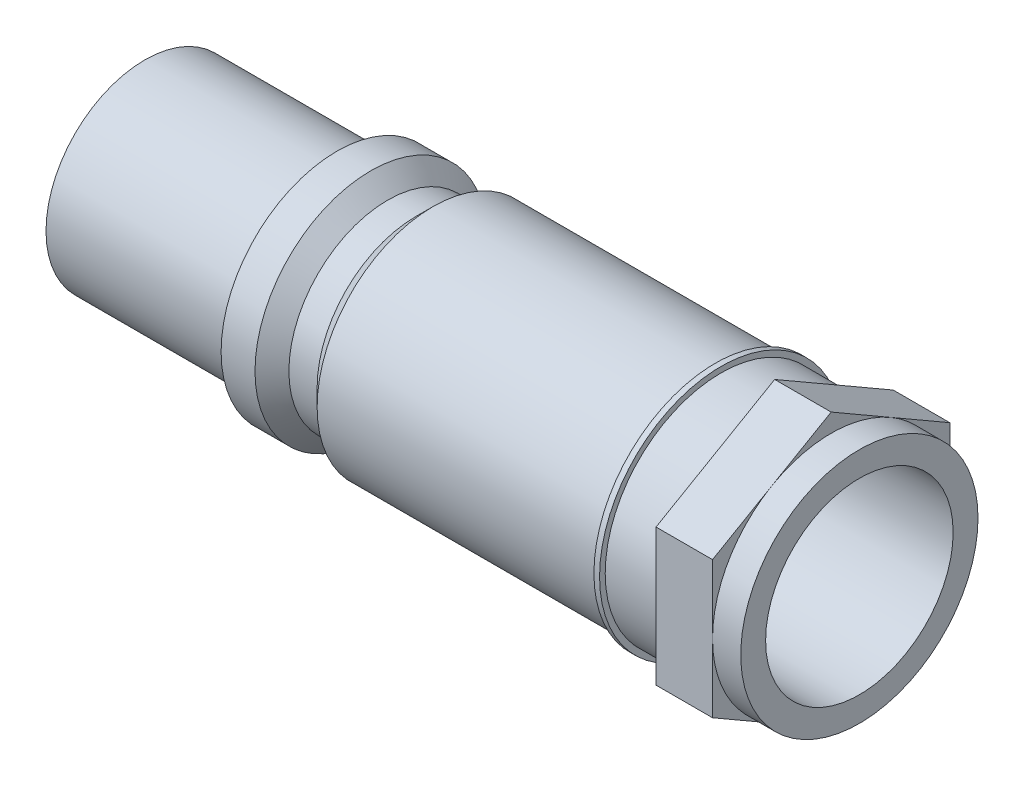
ISO-10303-21;
HEADER;
FILE_DESCRIPTION(('STEP AP214'),'2;1');
FILE_NAME('part.step','',(''),(''),'','','');
FILE_SCHEMA(('AUTOMOTIVE_DESIGN { 1 0 10303 214 1 1 1 1 }'));
ENDSEC;
DATA;
#1=APPLICATION_CONTEXT('core data for automotive mechanical design processes');
#2=APPLICATION_PROTOCOL_DEFINITION('international standard','automotive_design',2000,#1);
#3=PRODUCT_CONTEXT('',#1,'mechanical');
#4=PRODUCT('Part','Part','',(#3));
#5=PRODUCT_RELATED_PRODUCT_CATEGORY('part','',(#4));
#6=PRODUCT_DEFINITION_FORMATION('','',#4);
#7=PRODUCT_DEFINITION_CONTEXT('part definition',#1,'design');
#8=PRODUCT_DEFINITION('design','',#6,#7);
#9=PRODUCT_DEFINITION_SHAPE('','',#8);
#10=(LENGTH_UNIT() NAMED_UNIT(*) SI_UNIT(.MILLI.,.METRE.));
#11=(NAMED_UNIT(*) PLANE_ANGLE_UNIT() SI_UNIT($,.RADIAN.));
#12=(NAMED_UNIT(*) SI_UNIT($,.STERADIAN.) SOLID_ANGLE_UNIT());
#13=UNCERTAINTY_MEASURE_WITH_UNIT(LENGTH_MEASURE(1.E-05),#10,'distance_accuracy_value','');
#14=(GEOMETRIC_REPRESENTATION_CONTEXT(3) GLOBAL_UNCERTAINTY_ASSIGNED_CONTEXT((#13)) GLOBAL_UNIT_ASSIGNED_CONTEXT((#10,
#11,#12)) REPRESENTATION_CONTEXT('',''));
#15=CARTESIAN_POINT('',(0.,0.,0.));
#16=DIRECTION('',(0.,0.,1.));
#17=DIRECTION('',(1.,0.,0.));
#18=AXIS2_PLACEMENT_3D('',#15,#16,#17);
#19=CARTESIAN_POINT('',(121.5,0.,0.));
#20=DIRECTION('',(1.,0.,0.));
#21=DIRECTION('',(0.,0.,-1.));
#22=AXIS2_PLACEMENT_3D('',#19,#20,#21);
#23=PLANE('',#22);
#24=CARTESIAN_POINT('',(121.5,0.,0.));
#25=DIRECTION('',(1.,0.,0.));
#26=DIRECTION('',(0.,0.,-1.));
#27=AXIS2_PLACEMENT_3D('',#24,#25,#26);
#28=CIRCLE('',#27,21.);
#29=CARTESIAN_POINT('',(121.5,0.,-21.));
#30=VERTEX_POINT('',#29);
#31=CARTESIAN_POINT('',(121.5,18.1865334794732,-10.5));
#32=VERTEX_POINT('',#31);
#33=EDGE_CURVE('E44',#30,#32,#28,.T.);
#34=ORIENTED_EDGE('',*,*,#33,.F.);
#35=DIRECTION('',(0.,1.,0.));
#36=VECTOR('',#35,1.);
#37=CARTESIAN_POINT('',(121.5,-12.1243556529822,-21.));
#38=LINE('',#37,#36);
#39=CARTESIAN_POINT('',(121.5,12.1243556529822,-21.));
#40=VERTEX_POINT('',#39);
#41=EDGE_CURVE('E114',#30,#40,#38,.T.);
#42=ORIENTED_EDGE('',*,*,#41,.T.);
#43=DIRECTION('',(0.,0.5,0.866025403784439));
#44=VECTOR('',#43,1.);
#45=CARTESIAN_POINT('',(121.5,12.1243556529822,-21.));
#46=LINE('',#45,#44);
#47=EDGE_CURVE('E125',#40,#32,#46,.T.);
#48=ORIENTED_EDGE('',*,*,#47,.T.);
#49=EDGE_LOOP('',(#34,#42,#48));
#50=FACE_BOUND('',#49,.T.);
#51=ADVANCED_FACE('F33',(#50),#23,.T.);
#52=CARTESIAN_POINT('',(121.5,18.1865334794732,10.5));
#53=VERTEX_POINT('',#52);
#54=EDGE_CURVE('E11',#32,#53,#28,.T.);
#55=ORIENTED_EDGE('',*,*,#54,.F.);
#56=CARTESIAN_POINT('',(121.5,24.2487113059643,0.));
#57=VERTEX_POINT('',#56);
#58=EDGE_CURVE('E139',#32,#57,#46,.T.);
#59=ORIENTED_EDGE('',*,*,#58,.T.);
#60=DIRECTION('',(0.,-0.5,0.866025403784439));
#61=VECTOR('',#60,1.);
#62=CARTESIAN_POINT('',(121.5,24.2487113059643,0.));
#63=LINE('',#62,#61);
#64=EDGE_CURVE('E140',#57,#53,#63,.T.);
#65=ORIENTED_EDGE('',*,*,#64,.T.);
#66=EDGE_LOOP('',(#55,#59,#65));
#67=FACE_BOUND('',#66,.T.);
#68=ADVANCED_FACE('F288',(#67),#23,.T.);
#69=CARTESIAN_POINT('',(121.5,0.,21.));
#70=VERTEX_POINT('',#69);
#71=EDGE_CURVE('E42',#53,#70,#28,.T.);
#72=ORIENTED_EDGE('',*,*,#71,.F.);
#73=CARTESIAN_POINT('',(121.5,12.1243556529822,21.));
#74=VERTEX_POINT('',#73);
#75=EDGE_CURVE('E138',#53,#74,#63,.T.);
#76=ORIENTED_EDGE('',*,*,#75,.T.);
#77=DIRECTION('',(0.,-1.,0.));
#78=VECTOR('',#77,1.);
#79=CARTESIAN_POINT('',(121.5,12.1243556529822,21.));
#80=LINE('',#79,#78);
#81=EDGE_CURVE('E144',#74,#70,#80,.T.);
#82=ORIENTED_EDGE('',*,*,#81,.T.);
#83=EDGE_LOOP('',(#72,#76,#82));
#84=FACE_BOUND('',#83,.T.);
#85=ADVANCED_FACE('F295',(#84),#23,.T.);
#86=CARTESIAN_POINT('',(121.5,-18.1865334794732,10.5));
#87=VERTEX_POINT('',#86);
#88=EDGE_CURVE('E131',#70,#87,#28,.T.);
#89=ORIENTED_EDGE('',*,*,#88,.F.);
#90=CARTESIAN_POINT('',(121.5,-12.1243556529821,21.));
#91=VERTEX_POINT('',#90);
#92=EDGE_CURVE('E143',#70,#91,#80,.T.);
#93=ORIENTED_EDGE('',*,*,#92,.T.);
#94=DIRECTION('',(0.,-0.5,-0.866025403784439));
#95=VECTOR('',#94,1.);
#96=CARTESIAN_POINT('',(121.5,-12.1243556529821,21.));
#97=LINE('',#96,#95);
#98=EDGE_CURVE('E148',#91,#87,#97,.T.);
#99=ORIENTED_EDGE('',*,*,#98,.T.);
#100=EDGE_LOOP('',(#89,#93,#99));
#101=FACE_BOUND('',#100,.T.);
#102=ADVANCED_FACE('F299',(#101),#23,.T.);
#103=CARTESIAN_POINT('',(121.5,-18.1865334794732,-10.5));
#104=VERTEX_POINT('',#103);
#105=EDGE_CURVE('E59',#87,#104,#28,.T.);
#106=ORIENTED_EDGE('',*,*,#105,.F.);
#107=CARTESIAN_POINT('',(121.5,-24.2487113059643,0.));
#108=VERTEX_POINT('',#107);
#109=EDGE_CURVE('E147',#87,#108,#97,.T.);
#110=ORIENTED_EDGE('',*,*,#109,.T.);
#111=DIRECTION('',(0.,0.5,-0.866025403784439));
#112=VECTOR('',#111,1.);
#113=CARTESIAN_POINT('',(121.5,-24.2487113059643,0.));
#114=LINE('',#113,#112);
#115=EDGE_CURVE('E123',#108,#104,#114,.T.);
#116=ORIENTED_EDGE('',*,*,#115,.T.);
#117=EDGE_LOOP('',(#106,#110,#116));
#118=FACE_BOUND('',#117,.T.);
#119=ADVANCED_FACE('F309',(#118),#23,.T.);
#120=CARTESIAN_POINT('',(0.,0.,0.));
#121=DIRECTION('',(1.,0.,0.));
#122=DIRECTION('',(0.,0.,-1.));
#123=AXIS2_PLACEMENT_3D('',#120,#121,#122);
#124=PLANE('',#123);
#125=CARTESIAN_POINT('',(0.,0.,0.));
#126=DIRECTION('',(1.,0.,0.));
#127=DIRECTION('',(0.,0.,-1.));
#128=AXIS2_PLACEMENT_3D('',#125,#126,#127);
#129=CIRCLE('',#128,16.6);
#130=CARTESIAN_POINT('',(0.,0.,-16.6));
#131=VERTEX_POINT('',#130);
#132=EDGE_CURVE('E128',#131,#131,#129,.T.);
#133=ORIENTED_EDGE('',*,*,#132,.T.);
#134=EDGE_LOOP('',(#133));
#135=FACE_BOUND('',#134,.T.);
#136=CARTESIAN_POINT('',(0.,0.,0.));
#137=DIRECTION('',(-1.,0.,0.));
#138=DIRECTION('',(0.,0.,1.));
#139=AXIS2_PLACEMENT_3D('',#136,#137,#138);
#140=CIRCLE('',#139,17.5);
#141=CARTESIAN_POINT('',(0.,0.,17.5));
#142=VERTEX_POINT('',#141);
#143=EDGE_CURVE('E37',#142,#142,#140,.T.);
#144=ORIENTED_EDGE('',*,*,#143,.T.);
#145=EDGE_LOOP('',(#144));
#146=FACE_BOUND('',#145,.T.);
#147=ADVANCED_FACE('F35',(#135,#146),#124,.F.);
#148=CARTESIAN_POINT('',(0.,0.,0.));
#149=DIRECTION('',(-1.,0.,0.));
#150=DIRECTION('',(0.,0.,1.));
#151=AXIS2_PLACEMENT_3D('',#148,#149,#150);
#152=CYLINDRICAL_SURFACE('',#151,17.5);
#153=ORIENTED_EDGE('',*,*,#143,.F.);
#154=EDGE_LOOP('',(#153));
#155=FACE_BOUND('',#154,.T.);
#156=CARTESIAN_POINT('',(34.,0.,0.));
#157=DIRECTION('',(-1.,0.,0.));
#158=DIRECTION('',(0.,0.,1.));
#159=AXIS2_PLACEMENT_3D('',#156,#157,#158);
#160=CIRCLE('',#159,17.5);
#161=CARTESIAN_POINT('',(34.,0.,17.5));
#162=VERTEX_POINT('',#161);
#163=EDGE_CURVE('E133',#162,#162,#160,.T.);
#164=ORIENTED_EDGE('',*,*,#163,.T.);
#165=EDGE_LOOP('',(#164));
#166=FACE_BOUND('',#165,.T.);
#167=ADVANCED_FACE('F212',(#155,#166),#152,.T.);
#168=CARTESIAN_POINT('',(34.,17.5,0.));
#169=DIRECTION('',(1.,0.,0.));
#170=DIRECTION('',(0.,0.,-1.));
#171=AXIS2_PLACEMENT_3D('',#168,#169,#170);
#172=PLANE('',#171);
#173=ORIENTED_EDGE('',*,*,#163,.F.);
#174=EDGE_LOOP('',(#173));
#175=FACE_BOUND('',#174,.T.);
#176=CARTESIAN_POINT('',(34.,0.,0.));
#177=DIRECTION('',(-1.,0.,0.));
#178=DIRECTION('',(0.,0.,1.));
#179=AXIS2_PLACEMENT_3D('',#176,#177,#178);
#180=CIRCLE('',#179,20.5);
#181=CARTESIAN_POINT('',(34.,0.,20.5));
#182=VERTEX_POINT('',#181);
#183=EDGE_CURVE('E207',#182,#182,#180,.T.);
#184=ORIENTED_EDGE('',*,*,#183,.T.);
#185=EDGE_LOOP('',(#184));
#186=FACE_BOUND('',#185,.T.);
#187=ADVANCED_FACE('F214',(#175,#186),#172,.F.);
#188=CARTESIAN_POINT('',(0.,0.,0.));
#189=DIRECTION('',(-1.,0.,0.));
#190=DIRECTION('',(0.,0.,1.));
#191=AXIS2_PLACEMENT_3D('',#188,#189,#190);
#192=CYLINDRICAL_SURFACE('',#191,20.5);
#193=ORIENTED_EDGE('',*,*,#183,.F.);
#194=EDGE_LOOP('',(#193));
#195=FACE_BOUND('',#194,.T.);
#196=CARTESIAN_POINT('',(40.,0.,0.));
#197=DIRECTION('',(-1.,0.,0.));
#198=DIRECTION('',(0.,0.,1.));
#199=AXIS2_PLACEMENT_3D('',#196,#197,#198);
#200=CIRCLE('',#199,20.5);
#201=CARTESIAN_POINT('',(40.,0.,20.5));
#202=VERTEX_POINT('',#201);
#203=EDGE_CURVE('E204',#202,#202,#200,.T.);
#204=ORIENTED_EDGE('',*,*,#203,.T.);
#205=EDGE_LOOP('',(#204));
#206=FACE_BOUND('',#205,.T.);
#207=ADVANCED_FACE('F217',(#195,#206),#192,.T.);
#208=CARTESIAN_POINT('',(43.,0.,0.));
#209=DIRECTION('',(-1.,0.,0.));
#210=DIRECTION('',(0.,0.,1.));
#211=AXIS2_PLACEMENT_3D('',#208,#209,#210);
#212=CONICAL_SURFACE('',#211,17.5,0.785398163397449);
#213=ORIENTED_EDGE('',*,*,#203,.F.);
#214=EDGE_LOOP('',(#213));
#215=FACE_BOUND('',#214,.T.);
#216=CARTESIAN_POINT('',(43.,0.,0.));
#217=DIRECTION('',(-1.,0.,0.));
#218=DIRECTION('',(0.,0.,1.));
#219=AXIS2_PLACEMENT_3D('',#216,#217,#218);
#220=CIRCLE('',#219,17.5);
#221=CARTESIAN_POINT('',(43.,0.,17.5));
#222=VERTEX_POINT('',#221);
#223=EDGE_CURVE('E201',#222,#222,#220,.T.);
#224=ORIENTED_EDGE('',*,*,#223,.T.);
#225=EDGE_LOOP('',(#224));
#226=FACE_BOUND('',#225,.T.);
#227=ADVANCED_FACE('F223',(#215,#226),#212,.T.);
#228=CARTESIAN_POINT('',(0.,0.,0.));
#229=DIRECTION('',(-1.,0.,0.));
#230=DIRECTION('',(0.,0.,1.));
#231=AXIS2_PLACEMENT_3D('',#228,#229,#230);
#232=CYLINDRICAL_SURFACE('',#231,17.5);
#233=ORIENTED_EDGE('',*,*,#223,.F.);
#234=EDGE_LOOP('',(#233));
#235=FACE_BOUND('',#234,.T.);
#236=CARTESIAN_POINT('',(48.,0.,0.));
#237=DIRECTION('',(-1.,0.,0.));
#238=DIRECTION('',(0.,0.,1.));
#239=AXIS2_PLACEMENT_3D('',#236,#237,#238);
#240=CIRCLE('',#239,17.5);
#241=CARTESIAN_POINT('',(48.,0.,17.5));
#242=VERTEX_POINT('',#241);
#243=EDGE_CURVE('E198',#242,#242,#240,.T.);
#244=ORIENTED_EDGE('',*,*,#243,.T.);
#245=EDGE_LOOP('',(#244));
#246=FACE_BOUND('',#245,.T.);
#247=ADVANCED_FACE('F229',(#235,#246),#232,.T.);
#248=CARTESIAN_POINT('',(51.,0.,0.));
#249=DIRECTION('',(1.,0.,0.));
#250=DIRECTION('',(0.,0.,-1.));
#251=AXIS2_PLACEMENT_3D('',#248,#249,#250);
#252=CONICAL_SURFACE('',#251,20.5,0.785398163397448);
#253=ORIENTED_EDGE('',*,*,#243,.F.);
#254=EDGE_LOOP('',(#253));
#255=FACE_BOUND('',#254,.T.);
#256=CARTESIAN_POINT('',(51.,0.,0.));
#257=DIRECTION('',(-1.,0.,0.));
#258=DIRECTION('',(0.,0.,1.));
#259=AXIS2_PLACEMENT_3D('',#256,#257,#258);
#260=CIRCLE('',#259,20.5);
#261=CARTESIAN_POINT('',(51.,0.,20.5));
#262=VERTEX_POINT('',#261);
#263=EDGE_CURVE('E195',#262,#262,#260,.T.);
#264=ORIENTED_EDGE('',*,*,#263,.T.);
#265=EDGE_LOOP('',(#264));
#266=FACE_BOUND('',#265,.T.);
#267=ADVANCED_FACE('F235',(#255,#266),#252,.T.);
#268=CARTESIAN_POINT('',(0.,0.,0.));
#269=DIRECTION('',(-1.,0.,0.));
#270=DIRECTION('',(0.,0.,1.));
#271=AXIS2_PLACEMENT_3D('',#268,#269,#270);
#272=CYLINDRICAL_SURFACE('',#271,20.5);
#273=ORIENTED_EDGE('',*,*,#263,.F.);
#274=EDGE_LOOP('',(#273));
#275=FACE_BOUND('',#274,.T.);
#276=CARTESIAN_POINT('',(101.,0.,0.));
#277=DIRECTION('',(-1.,0.,0.));
#278=DIRECTION('',(0.,0.,1.));
#279=AXIS2_PLACEMENT_3D('',#276,#277,#278);
#280=CIRCLE('',#279,20.5);
#281=CARTESIAN_POINT('',(101.,0.,20.5));
#282=VERTEX_POINT('',#281);
#283=EDGE_CURVE('E192',#282,#282,#280,.T.);
#284=ORIENTED_EDGE('',*,*,#283,.T.);
#285=EDGE_LOOP('',(#284));
#286=FACE_BOUND('',#285,.T.);
#287=ADVANCED_FACE('F241',(#275,#286),#272,.T.);
#288=CARTESIAN_POINT('',(101.,20.5,0.));
#289=DIRECTION('',(1.,0.,0.));
#290=DIRECTION('',(0.,0.,-1.));
#291=AXIS2_PLACEMENT_3D('',#288,#289,#290);
#292=PLANE('',#291);
#293=ORIENTED_EDGE('',*,*,#283,.F.);
#294=EDGE_LOOP('',(#293));
#295=FACE_BOUND('',#294,.T.);
#296=CARTESIAN_POINT('',(101.,0.,0.));
#297=DIRECTION('',(-1.,0.,0.));
#298=DIRECTION('',(0.,0.,1.));
#299=AXIS2_PLACEMENT_3D('',#296,#297,#298);
#300=CIRCLE('',#299,21.5);
#301=CARTESIAN_POINT('',(101.,0.,21.5));
#302=VERTEX_POINT('',#301);
#303=EDGE_CURVE('E189',#302,#302,#300,.T.);
#304=ORIENTED_EDGE('',*,*,#303,.T.);
#305=EDGE_LOOP('',(#304));
#306=FACE_BOUND('',#305,.T.);
#307=ADVANCED_FACE('F247',(#295,#306),#292,.F.);
#308=CARTESIAN_POINT('',(0.,0.,0.));
#309=DIRECTION('',(-1.,0.,0.));
#310=DIRECTION('',(0.,0.,1.));
#311=AXIS2_PLACEMENT_3D('',#308,#309,#310);
#312=CYLINDRICAL_SURFACE('',#311,21.5);
#313=ORIENTED_EDGE('',*,*,#303,.F.);
#314=EDGE_LOOP('',(#313));
#315=FACE_BOUND('',#314,.T.);
#316=CARTESIAN_POINT('',(102.,0.,0.));
#317=DIRECTION('',(-1.,0.,0.));
#318=DIRECTION('',(0.,0.,1.));
#319=AXIS2_PLACEMENT_3D('',#316,#317,#318);
#320=CIRCLE('',#319,21.5);
#321=CARTESIAN_POINT('',(102.,0.,21.5));
#322=VERTEX_POINT('',#321);
#323=EDGE_CURVE('E186',#322,#322,#320,.T.);
#324=ORIENTED_EDGE('',*,*,#323,.T.);
#325=EDGE_LOOP('',(#324));
#326=FACE_BOUND('',#325,.T.);
#327=ADVANCED_FACE('F253',(#315,#326),#312,.T.);
#328=CARTESIAN_POINT('',(102.,21.5,0.));
#329=DIRECTION('',(-1.,0.,0.));
#330=DIRECTION('',(0.,0.,1.));
#331=AXIS2_PLACEMENT_3D('',#328,#329,#330);
#332=PLANE('',#331);
#333=ORIENTED_EDGE('',*,*,#323,.F.);
#334=EDGE_LOOP('',(#333));
#335=FACE_BOUND('',#334,.T.);
#336=CARTESIAN_POINT('',(102.,0.,0.));
#337=DIRECTION('',(-1.,0.,0.));
#338=DIRECTION('',(0.,0.,1.));
#339=AXIS2_PLACEMENT_3D('',#336,#337,#338);
#340=CIRCLE('',#339,20.5);
#341=CARTESIAN_POINT('',(102.,0.,20.5));
#342=VERTEX_POINT('',#341);
#343=EDGE_CURVE('E183',#342,#342,#340,.T.);
#344=ORIENTED_EDGE('',*,*,#343,.T.);
#345=EDGE_LOOP('',(#344));
#346=FACE_BOUND('',#345,.T.);
#347=ADVANCED_FACE('F259',(#335,#346),#332,.F.);
#348=CARTESIAN_POINT('',(0.,0.,0.));
#349=DIRECTION('',(-1.,0.,0.));
#350=DIRECTION('',(0.,0.,1.));
#351=AXIS2_PLACEMENT_3D('',#348,#349,#350);
#352=CYLINDRICAL_SURFACE('',#351,20.5);
#353=ORIENTED_EDGE('',*,*,#343,.F.);
#354=EDGE_LOOP('',(#353));
#355=FACE_BOUND('',#354,.T.);
#356=CARTESIAN_POINT('',(111.5,0.,0.));
#357=DIRECTION('',(-1.,0.,0.));
#358=DIRECTION('',(0.,0.,1.));
#359=AXIS2_PLACEMENT_3D('',#356,#357,#358);
#360=CIRCLE('',#359,20.5);
#361=CARTESIAN_POINT('',(111.5,0.,20.5));
#362=VERTEX_POINT('',#361);
#363=EDGE_CURVE('E180',#362,#362,#360,.T.);
#364=ORIENTED_EDGE('',*,*,#363,.T.);
#365=EDGE_LOOP('',(#364));
#366=FACE_BOUND('',#365,.T.);
#367=ADVANCED_FACE('F265',(#355,#366),#352,.T.);
#368=CARTESIAN_POINT('',(121.5,12.1243556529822,-21.));
#369=DIRECTION('',(0.,-0.866025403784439,0.5));
#370=DIRECTION('',(0.,-0.5,-0.866025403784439));
#371=AXIS2_PLACEMENT_3D('',#368,#369,#370);
#372=PLANE('',#371);
#373=DIRECTION('',(0.,0.5,0.866025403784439));
#374=VECTOR('',#373,1.);
#375=CARTESIAN_POINT('',(111.5,12.1243556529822,-21.));
#376=LINE('',#375,#374);
#377=CARTESIAN_POINT('',(111.5,12.1243556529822,-21.));
#378=VERTEX_POINT('',#377);
#379=CARTESIAN_POINT('',(111.5,24.2487113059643,0.));
#380=VERTEX_POINT('',#379);
#381=EDGE_CURVE('E152',#378,#380,#376,.T.);
#382=ORIENTED_EDGE('',*,*,#381,.T.);
#383=DIRECTION('',(-1.,0.,0.));
#384=VECTOR('',#383,1.);
#385=CARTESIAN_POINT('',(121.5,24.2487113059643,0.));
#386=LINE('',#385,#384);
#387=EDGE_CURVE('E177',#57,#380,#386,.T.);
#388=ORIENTED_EDGE('',*,*,#387,.F.);
#389=ORIENTED_EDGE('',*,*,#58,.F.);
#390=ORIENTED_EDGE('',*,*,#47,.F.);
#391=DIRECTION('',(-1.,0.,0.));
#392=VECTOR('',#391,1.);
#393=CARTESIAN_POINT('',(121.5,12.1243556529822,-21.));
#394=LINE('',#393,#392);
#395=EDGE_CURVE('E113',#40,#378,#394,.T.);
#396=ORIENTED_EDGE('',*,*,#395,.T.);
#397=EDGE_LOOP('',(#382,#388,#389,#390,#396));
#398=FACE_BOUND('',#397,.T.);
#399=ADVANCED_FACE('F271',(#398),#372,.F.);
#400=CARTESIAN_POINT('',(121.5,24.2487113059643,0.));
#401=DIRECTION('',(0.,-0.866025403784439,-0.5));
#402=DIRECTION('',(0.,0.5,-0.866025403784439));
#403=AXIS2_PLACEMENT_3D('',#400,#401,#402);
#404=PLANE('',#403);
#405=DIRECTION('',(0.,-0.5,0.866025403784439));
#406=VECTOR('',#405,1.);
#407=CARTESIAN_POINT('',(111.5,24.2487113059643,0.));
#408=LINE('',#407,#406);
#409=CARTESIAN_POINT('',(111.5,12.1243556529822,21.));
#410=VERTEX_POINT('',#409);
#411=EDGE_CURVE('E155',#380,#410,#408,.T.);
#412=ORIENTED_EDGE('',*,*,#411,.T.);
#413=DIRECTION('',(-1.,0.,0.));
#414=VECTOR('',#413,1.);
#415=CARTESIAN_POINT('',(121.5,12.1243556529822,21.));
#416=LINE('',#415,#414);
#417=EDGE_CURVE('E174',#74,#410,#416,.T.);
#418=ORIENTED_EDGE('',*,*,#417,.F.);
#419=ORIENTED_EDGE('',*,*,#75,.F.);
#420=ORIENTED_EDGE('',*,*,#64,.F.);
#421=ORIENTED_EDGE('',*,*,#387,.T.);
#422=EDGE_LOOP('',(#412,#418,#419,#420,#421));
#423=FACE_BOUND('',#422,.T.);
#424=ADVANCED_FACE('F291',(#423),#404,.F.);
#425=CARTESIAN_POINT('',(121.5,12.1243556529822,21.));
#426=DIRECTION('',(0.,0.,-1.));
#427=DIRECTION('',(-1.,0.,0.));
#428=AXIS2_PLACEMENT_3D('',#425,#426,#427);
#429=PLANE('',#428);
#430=DIRECTION('',(0.,-1.,0.));
#431=VECTOR('',#430,1.);
#432=CARTESIAN_POINT('',(111.5,12.1243556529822,21.));
#433=LINE('',#432,#431);
#434=CARTESIAN_POINT('',(111.5,-12.1243556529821,21.));
#435=VERTEX_POINT('',#434);
#436=EDGE_CURVE('E157',#410,#435,#433,.T.);
#437=ORIENTED_EDGE('',*,*,#436,.T.);
#438=DIRECTION('',(-1.,0.,0.));
#439=VECTOR('',#438,1.);
#440=CARTESIAN_POINT('',(121.5,-12.1243556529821,21.));
#441=LINE('',#440,#439);
#442=EDGE_CURVE('E171',#91,#435,#441,.T.);
#443=ORIENTED_EDGE('',*,*,#442,.F.);
#444=ORIENTED_EDGE('',*,*,#92,.F.);
#445=ORIENTED_EDGE('',*,*,#81,.F.);
#446=ORIENTED_EDGE('',*,*,#417,.T.);
#447=EDGE_LOOP('',(#437,#443,#444,#445,#446));
#448=FACE_BOUND('',#447,.T.);
#449=ADVANCED_FACE('F303',(#448),#429,.F.);
#450=CARTESIAN_POINT('',(121.5,-12.1243556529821,21.));
#451=DIRECTION('',(0.,0.866025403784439,-0.5));
#452=DIRECTION('',(0.,0.5,0.866025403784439));
#453=AXIS2_PLACEMENT_3D('',#450,#451,#452);
#454=PLANE('',#453);
#455=DIRECTION('',(0.,-0.5,-0.866025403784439));
#456=VECTOR('',#455,1.);
#457=CARTESIAN_POINT('',(111.5,-12.1243556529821,21.));
#458=LINE('',#457,#456);
#459=CARTESIAN_POINT('',(111.5,-24.2487113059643,0.));
#460=VERTEX_POINT('',#459);
#461=EDGE_CURVE('E159',#435,#460,#458,.T.);
#462=ORIENTED_EDGE('',*,*,#461,.T.);
#463=DIRECTION('',(-1.,0.,0.));
#464=VECTOR('',#463,1.);
#465=CARTESIAN_POINT('',(121.5,-24.2487113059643,0.));
#466=LINE('',#465,#464);
#467=EDGE_CURVE('E168',#108,#460,#466,.T.);
#468=ORIENTED_EDGE('',*,*,#467,.F.);
#469=ORIENTED_EDGE('',*,*,#109,.F.);
#470=ORIENTED_EDGE('',*,*,#98,.F.);
#471=ORIENTED_EDGE('',*,*,#442,.T.);
#472=EDGE_LOOP('',(#462,#468,#469,#470,#471));
#473=FACE_BOUND('',#472,.T.);
#474=ADVANCED_FACE('F306',(#473),#454,.F.);
#475=CARTESIAN_POINT('',(121.5,-24.2487113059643,0.));
#476=DIRECTION('',(0.,0.866025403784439,0.5));
#477=DIRECTION('',(0.,-0.5,0.866025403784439));
#478=AXIS2_PLACEMENT_3D('',#475,#476,#477);
#479=PLANE('',#478);
#480=DIRECTION('',(0.,0.5,-0.866025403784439));
#481=VECTOR('',#480,1.);
#482=CARTESIAN_POINT('',(111.5,-24.2487113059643,0.));
#483=LINE('',#482,#481);
#484=CARTESIAN_POINT('',(111.5,-12.1243556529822,-21.));
#485=VERTEX_POINT('',#484);
#486=EDGE_CURVE('E161',#460,#485,#483,.T.);
#487=ORIENTED_EDGE('',*,*,#486,.T.);
#488=DIRECTION('',(-1.,0.,0.));
#489=VECTOR('',#488,1.);
#490=CARTESIAN_POINT('',(121.5,-12.1243556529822,-21.));
#491=LINE('',#490,#489);
#492=CARTESIAN_POINT('',(121.5,-12.1243556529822,-21.));
#493=VERTEX_POINT('',#492);
#494=EDGE_CURVE('E166',#493,#485,#491,.T.);
#495=ORIENTED_EDGE('',*,*,#494,.F.);
#496=EDGE_CURVE('E109',#104,#493,#114,.T.);
#497=ORIENTED_EDGE('',*,*,#496,.F.);
#498=ORIENTED_EDGE('',*,*,#115,.F.);
#499=ORIENTED_EDGE('',*,*,#467,.T.);
#500=EDGE_LOOP('',(#487,#495,#497,#498,#499));
#501=FACE_BOUND('',#500,.T.);
#502=ADVANCED_FACE('F311',(#501),#479,.F.);
#503=CARTESIAN_POINT('',(121.5,-12.1243556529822,-21.));
#504=DIRECTION('',(0.,0.,1.));
#505=DIRECTION('',(0.,-1.,0.));
#506=AXIS2_PLACEMENT_3D('',#503,#504,#505);
#507=PLANE('',#506);
#508=DIRECTION('',(0.,1.,0.));
#509=VECTOR('',#508,1.);
#510=CARTESIAN_POINT('',(111.5,-12.1243556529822,-21.));
#511=LINE('',#510,#509);
#512=EDGE_CURVE('E163',#485,#378,#511,.T.);
#513=ORIENTED_EDGE('',*,*,#512,.T.);
#514=ORIENTED_EDGE('',*,*,#395,.F.);
#515=ORIENTED_EDGE('',*,*,#41,.F.);
#516=EDGE_CURVE('E106',#493,#30,#38,.T.);
#517=ORIENTED_EDGE('',*,*,#516,.F.);
#518=ORIENTED_EDGE('',*,*,#494,.T.);
#519=EDGE_LOOP('',(#513,#514,#515,#517,#518));
#520=FACE_BOUND('',#519,.T.);
#521=ADVANCED_FACE('F118',(#520),#507,.F.);
#522=EDGE_CURVE('E51',#104,#30,#28,.T.);
#523=ORIENTED_EDGE('',*,*,#522,.F.);
#524=ORIENTED_EDGE('',*,*,#496,.T.);
#525=ORIENTED_EDGE('',*,*,#516,.T.);
#526=EDGE_LOOP('',(#523,#524,#525));
#527=FACE_BOUND('',#526,.T.);
#528=ADVANCED_FACE('F108',(#527),#23,.T.);
#529=CARTESIAN_POINT('',(111.5,0.,0.));
#530=DIRECTION('',(1.,0.,0.));
#531=DIRECTION('',(0.,0.,-1.));
#532=AXIS2_PLACEMENT_3D('',#529,#530,#531);
#533=PLANE('',#532);
#534=ORIENTED_EDGE('',*,*,#363,.F.);
#535=EDGE_LOOP('',(#534));
#536=FACE_BOUND('',#535,.T.);
#537=ORIENTED_EDGE('',*,*,#381,.F.);
#538=ORIENTED_EDGE('',*,*,#512,.F.);
#539=ORIENTED_EDGE('',*,*,#486,.F.);
#540=ORIENTED_EDGE('',*,*,#461,.F.);
#541=ORIENTED_EDGE('',*,*,#436,.F.);
#542=ORIENTED_EDGE('',*,*,#411,.F.);
#543=EDGE_LOOP('',(#537,#538,#539,#540,#541,#542));
#544=FACE_BOUND('',#543,.T.);
#545=ADVANCED_FACE('F275',(#536,#544),#533,.F.);
#546=CARTESIAN_POINT('',(126.5,0.,0.));
#547=DIRECTION('',(-1.,0.,0.));
#548=DIRECTION('',(0.,0.,1.));
#549=AXIS2_PLACEMENT_3D('',#546,#547,#548);
#550=CYLINDRICAL_SURFACE('',#549,21.);
#551=CARTESIAN_POINT('',(126.5,0.,0.));
#552=DIRECTION('',(1.,0.,0.));
#553=DIRECTION('',(0.,0.,-1.));
#554=AXIS2_PLACEMENT_3D('',#551,#552,#553);
#555=CIRCLE('',#554,21.);
#556=CARTESIAN_POINT('',(126.5,0.,-21.));
#557=VERTEX_POINT('',#556);
#558=EDGE_CURVE('E127',#557,#557,#555,.T.);
#559=ORIENTED_EDGE('',*,*,#558,.F.);
#560=EDGE_LOOP('',(#559));
#561=FACE_BOUND('',#560,.T.);
#562=ORIENTED_EDGE('',*,*,#33,.T.);
#563=ORIENTED_EDGE('',*,*,#54,.T.);
#564=ORIENTED_EDGE('',*,*,#71,.T.);
#565=ORIENTED_EDGE('',*,*,#88,.T.);
#566=ORIENTED_EDGE('',*,*,#105,.T.);
#567=ORIENTED_EDGE('',*,*,#522,.T.);
#568=EDGE_LOOP('',(#562,#563,#564,#565,#566,#567));
#569=FACE_BOUND('',#568,.T.);
#570=ADVANCED_FACE('F129',(#561,#569),#550,.T.);
#571=CARTESIAN_POINT('',(126.5,0.,0.));
#572=DIRECTION('',(1.,0.,0.));
#573=DIRECTION('',(0.,0.,-1.));
#574=AXIS2_PLACEMENT_3D('',#571,#572,#573);
#575=PLANE('',#574);
#576=CARTESIAN_POINT('',(126.5,0.,0.));
#577=DIRECTION('',(1.,0.,0.));
#578=DIRECTION('',(0.,0.,-1.));
#579=AXIS2_PLACEMENT_3D('',#576,#577,#578);
#580=CIRCLE('',#579,16.6);
#581=CARTESIAN_POINT('',(126.5,0.,-16.6));
#582=VERTEX_POINT('',#581);
#583=EDGE_CURVE('E470',#582,#582,#580,.T.);
#584=ORIENTED_EDGE('',*,*,#583,.F.);
#585=EDGE_LOOP('',(#584));
#586=FACE_BOUND('',#585,.T.);
#587=ORIENTED_EDGE('',*,*,#558,.T.);
#588=EDGE_LOOP('',(#587));
#589=FACE_BOUND('',#588,.T.);
#590=ADVANCED_FACE('F441',(#586,#589),#575,.T.);
#591=CARTESIAN_POINT('',(0.,0.,0.));
#592=DIRECTION('',(1.,0.,0.));
#593=DIRECTION('',(0.,0.,-1.));
#594=AXIS2_PLACEMENT_3D('',#591,#592,#593);
#595=CYLINDRICAL_SURFACE('',#594,16.6);
#596=ORIENTED_EDGE('',*,*,#132,.F.);
#597=EDGE_LOOP('',(#596));
#598=FACE_BOUND('',#597,.T.);
#599=ORIENTED_EDGE('',*,*,#583,.T.);
#600=EDGE_LOOP('',(#599));
#601=FACE_BOUND('',#600,.T.);
#602=ADVANCED_FACE('F446',(#598,#601),#595,.F.);
#603=CLOSED_SHELL('',(#51,#68,#85,#102,#119,#147,#167,#187,#207,#227,#247,#267,#287,#307,#327,
#347,#367,#399,#424,#449,#474,#502,#521,#528,#545,#570,#590,#602));
#604=MANIFOLD_SOLID_BREP('B2',#603);
#605=ADVANCED_BREP_SHAPE_REPRESENTATION('',(#18,#604),#14);
#606=SHAPE_DEFINITION_REPRESENTATION(#9,#605);
ENDSEC;
END-ISO-10303-21;
